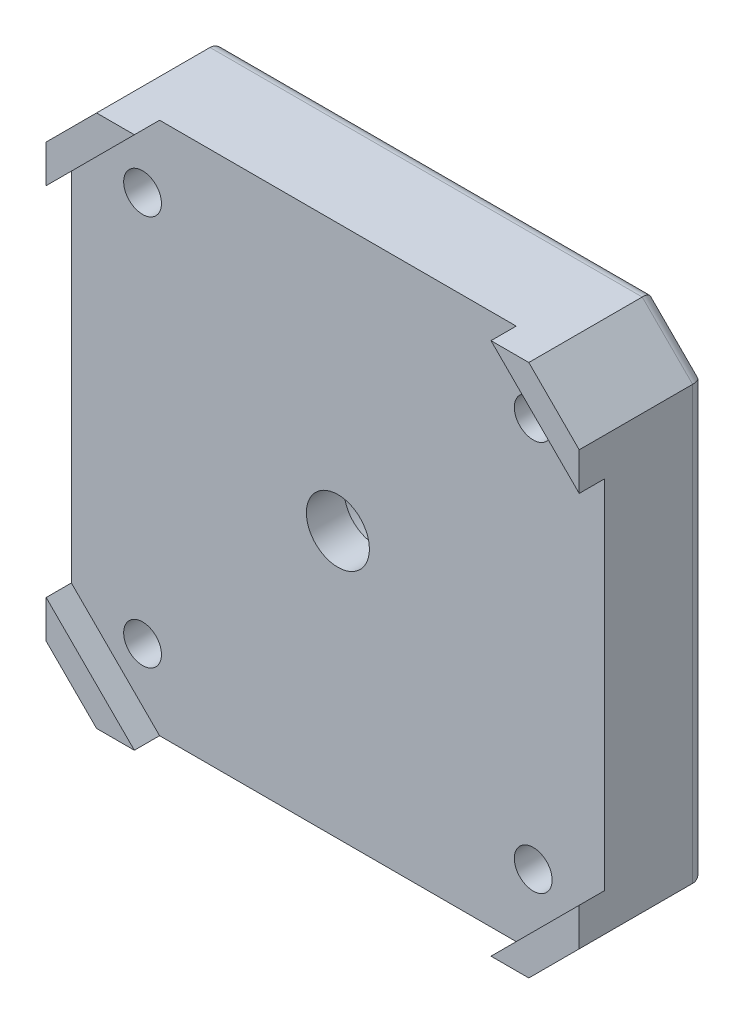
ISO-10303-21;
HEADER;
FILE_DESCRIPTION(('STEP AP214'),'2;1');
FILE_NAME('part.step','',(''),(''),'','','');
FILE_SCHEMA(('AUTOMOTIVE_DESIGN { 1 0 10303 214 1 1 1 1 }'));
ENDSEC;
DATA;
#1=APPLICATION_CONTEXT('core data for automotive mechanical design processes');
#2=APPLICATION_PROTOCOL_DEFINITION('international standard','automotive_design',2000,#1);
#3=PRODUCT_CONTEXT('',#1,'mechanical');
#4=PRODUCT('Part','Part','',(#3));
#5=PRODUCT_RELATED_PRODUCT_CATEGORY('part','',(#4));
#6=PRODUCT_DEFINITION_FORMATION('','',#4);
#7=PRODUCT_DEFINITION_CONTEXT('part definition',#1,'design');
#8=PRODUCT_DEFINITION('design','',#6,#7);
#9=PRODUCT_DEFINITION_SHAPE('','',#8);
#10=(LENGTH_UNIT() NAMED_UNIT(*) SI_UNIT(.MILLI.,.METRE.));
#11=(NAMED_UNIT(*) PLANE_ANGLE_UNIT() SI_UNIT($,.RADIAN.));
#12=(NAMED_UNIT(*) SI_UNIT($,.STERADIAN.) SOLID_ANGLE_UNIT());
#13=UNCERTAINTY_MEASURE_WITH_UNIT(LENGTH_MEASURE(1.E-05),#10,'distance_accuracy_value','');
#14=(GEOMETRIC_REPRESENTATION_CONTEXT(3) GLOBAL_UNCERTAINTY_ASSIGNED_CONTEXT((#13)) GLOBAL_UNIT_ASSIGNED_CONTEXT((#10,
#11,#12)) REPRESENTATION_CONTEXT('',''));
#15=CARTESIAN_POINT('',(0.,0.,0.));
#16=DIRECTION('',(0.,0.,1.));
#17=DIRECTION('',(1.,0.,0.));
#18=AXIS2_PLACEMENT_3D('',#15,#16,#17);
#19=CARTESIAN_POINT('',(-15.5,15.5,0.));
#20=DIRECTION('',(0.,0.,1.));
#21=DIRECTION('',(1.,0.,0.));
#22=AXIS2_PLACEMENT_3D('',#19,#20,#21);
#23=CYLINDRICAL_SURFACE('',#22,1.5);
#24=CARTESIAN_POINT('',(-15.5,15.5,8.));
#25=DIRECTION('',(0.,0.,1.));
#26=DIRECTION('',(1.,0.,0.));
#27=AXIS2_PLACEMENT_3D('',#24,#25,#26);
#28=CIRCLE('',#27,1.5);
#29=CARTESIAN_POINT('',(-14.,15.5,8.));
#30=VERTEX_POINT('',#29);
#31=EDGE_CURVE('E410',#30,#30,#28,.T.);
#32=ORIENTED_EDGE('',*,*,#31,.T.);
#33=EDGE_LOOP('',(#32));
#34=FACE_BOUND('',#33,.T.);
#35=CARTESIAN_POINT('',(-15.5,15.5,3.));
#36=DIRECTION('',(0.,0.,-1.));
#37=DIRECTION('',(-1.,0.,0.));
#38=AXIS2_PLACEMENT_3D('',#35,#36,#37);
#39=CIRCLE('',#38,1.5);
#40=CARTESIAN_POINT('',(-17.,15.5,3.));
#41=VERTEX_POINT('',#40);
#42=EDGE_CURVE('E262',#41,#41,#39,.F.);
#43=ORIENTED_EDGE('',*,*,#42,.F.);
#44=EDGE_LOOP('',(#43));
#45=FACE_BOUND('',#44,.T.);
#46=ADVANCED_FACE('F36',(#34,#45),#23,.F.);
#47=CARTESIAN_POINT('',(15.5,15.5,0.));
#48=DIRECTION('',(0.,0.,1.));
#49=DIRECTION('',(1.,0.,0.));
#50=AXIS2_PLACEMENT_3D('',#47,#48,#49);
#51=CYLINDRICAL_SURFACE('',#50,1.5);
#52=CARTESIAN_POINT('',(15.5,15.5,8.));
#53=DIRECTION('',(0.,0.,1.));
#54=DIRECTION('',(1.,0.,0.));
#55=AXIS2_PLACEMENT_3D('',#52,#53,#54);
#56=CIRCLE('',#55,1.5);
#57=CARTESIAN_POINT('',(17.,15.5,8.));
#58=VERTEX_POINT('',#57);
#59=EDGE_CURVE('E407',#58,#58,#56,.T.);
#60=ORIENTED_EDGE('',*,*,#59,.T.);
#61=EDGE_LOOP('',(#60));
#62=FACE_BOUND('',#61,.T.);
#63=CARTESIAN_POINT('',(15.5,15.5,3.));
#64=DIRECTION('',(0.,0.,-1.));
#65=DIRECTION('',(-1.,0.,0.));
#66=AXIS2_PLACEMENT_3D('',#63,#64,#65);
#67=CIRCLE('',#66,1.5);
#68=CARTESIAN_POINT('',(14.,15.5,3.));
#69=VERTEX_POINT('',#68);
#70=EDGE_CURVE('E259',#69,#69,#67,.F.);
#71=ORIENTED_EDGE('',*,*,#70,.F.);
#72=EDGE_LOOP('',(#71));
#73=FACE_BOUND('',#72,.T.);
#74=ADVANCED_FACE('F556',(#62,#73),#51,.F.);
#75=CARTESIAN_POINT('',(15.5,-15.5,0.));
#76=DIRECTION('',(0.,0.,1.));
#77=DIRECTION('',(1.,0.,0.));
#78=AXIS2_PLACEMENT_3D('',#75,#76,#77);
#79=CYLINDRICAL_SURFACE('',#78,1.5);
#80=CARTESIAN_POINT('',(15.5,-15.5,8.));
#81=DIRECTION('',(0.,0.,1.));
#82=DIRECTION('',(1.,0.,0.));
#83=AXIS2_PLACEMENT_3D('',#80,#81,#82);
#84=CIRCLE('',#83,1.5);
#85=CARTESIAN_POINT('',(17.,-15.5,8.));
#86=VERTEX_POINT('',#85);
#87=EDGE_CURVE('E411',#86,#86,#84,.T.);
#88=ORIENTED_EDGE('',*,*,#87,.T.);
#89=EDGE_LOOP('',(#88));
#90=FACE_BOUND('',#89,.T.);
#91=CARTESIAN_POINT('',(15.5,-15.5,3.));
#92=DIRECTION('',(0.,0.,-1.));
#93=DIRECTION('',(-1.,0.,0.));
#94=AXIS2_PLACEMENT_3D('',#91,#92,#93);
#95=CIRCLE('',#94,1.5);
#96=CARTESIAN_POINT('',(14.,-15.5,3.));
#97=VERTEX_POINT('',#96);
#98=EDGE_CURVE('E255',#97,#97,#95,.F.);
#99=ORIENTED_EDGE('',*,*,#98,.F.);
#100=EDGE_LOOP('',(#99));
#101=FACE_BOUND('',#100,.T.);
#102=ADVANCED_FACE('F558',(#90,#101),#79,.F.);
#103=CARTESIAN_POINT('',(-15.5,-15.5,0.));
#104=DIRECTION('',(0.,0.,1.));
#105=DIRECTION('',(1.,0.,0.));
#106=AXIS2_PLACEMENT_3D('',#103,#104,#105);
#107=CYLINDRICAL_SURFACE('',#106,1.5);
#108=CARTESIAN_POINT('',(-15.5,-15.5,8.));
#109=DIRECTION('',(0.,0.,1.));
#110=DIRECTION('',(1.,0.,0.));
#111=AXIS2_PLACEMENT_3D('',#108,#109,#110);
#112=CIRCLE('',#111,1.5);
#113=CARTESIAN_POINT('',(-14.,-15.5,8.));
#114=VERTEX_POINT('',#113);
#115=EDGE_CURVE('E265',#114,#114,#112,.T.);
#116=ORIENTED_EDGE('',*,*,#115,.T.);
#117=EDGE_LOOP('',(#116));
#118=FACE_BOUND('',#117,.T.);
#119=CARTESIAN_POINT('',(-15.5,-15.5,3.));
#120=DIRECTION('',(0.,0.,-1.));
#121=DIRECTION('',(-1.,0.,0.));
#122=AXIS2_PLACEMENT_3D('',#119,#120,#121);
#123=CIRCLE('',#122,1.5);
#124=CARTESIAN_POINT('',(-17.,-15.5,3.));
#125=VERTEX_POINT('',#124);
#126=EDGE_CURVE('E252',#125,#125,#123,.F.);
#127=ORIENTED_EDGE('',*,*,#126,.F.);
#128=EDGE_LOOP('',(#127));
#129=FACE_BOUND('',#128,.T.);
#130=ADVANCED_FACE('F565',(#118,#129),#107,.F.);
#131=CARTESIAN_POINT('',(0.,0.,10.));
#132=DIRECTION('',(0.,0.,-1.));
#133=DIRECTION('',(-1.,0.,0.));
#134=AXIS2_PLACEMENT_3D('',#131,#132,#133);
#135=PLANE('',#134);
#136=DIRECTION('',(0.,1.,0.));
#137=VECTOR('',#136,1.);
#138=CARTESIAN_POINT('',(21.15,17.15,10.));
#139=LINE('',#138,#137);
#140=CARTESIAN_POINT('',(21.15,-17.15,10.));
#141=VERTEX_POINT('',#140);
#142=CARTESIAN_POINT('',(21.15,-14.15,10.));
#143=VERTEX_POINT('',#142);
#144=EDGE_CURVE('E225',#141,#143,#139,.T.);
#145=ORIENTED_EDGE('',*,*,#144,.T.);
#146=DIRECTION('',(0.707106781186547,0.707106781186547,0.));
#147=VECTOR('',#146,1.);
#148=CARTESIAN_POINT('',(21.15,-14.15,10.));
#149=LINE('',#148,#147);
#150=CARTESIAN_POINT('',(14.15,-21.15,10.));
#151=VERTEX_POINT('',#150);
#152=EDGE_CURVE('E195',#151,#143,#149,.T.);
#153=ORIENTED_EDGE('',*,*,#152,.F.);
#154=DIRECTION('',(1.,0.,0.));
#155=VECTOR('',#154,1.);
#156=CARTESIAN_POINT('',(-17.15,-21.15,10.));
#157=LINE('',#156,#155);
#158=CARTESIAN_POINT('',(17.15,-21.15,10.));
#159=VERTEX_POINT('',#158);
#160=EDGE_CURVE('E219',#151,#159,#157,.T.);
#161=ORIENTED_EDGE('',*,*,#160,.T.);
#162=DIRECTION('',(0.707106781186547,0.707106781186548,0.));
#163=VECTOR('',#162,1.);
#164=CARTESIAN_POINT('',(21.15,-17.15,10.));
#165=LINE('',#164,#163);
#166=EDGE_CURVE('E223',#159,#141,#165,.T.);
#167=ORIENTED_EDGE('',*,*,#166,.T.);
#168=EDGE_LOOP('',(#145,#153,#161,#167));
#169=FACE_BOUND('',#168,.T.);
#170=ADVANCED_FACE('F572',(#169),#135,.F.);
#171=CARTESIAN_POINT('',(-17.15,-21.15,10.));
#172=VERTEX_POINT('',#171);
#173=CARTESIAN_POINT('',(-14.15,-21.15,10.));
#174=VERTEX_POINT('',#173);
#175=EDGE_CURVE('E220',#172,#174,#157,.T.);
#176=ORIENTED_EDGE('',*,*,#175,.T.);
#177=DIRECTION('',(0.707106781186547,-0.707106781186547,0.));
#178=VECTOR('',#177,1.);
#179=CARTESIAN_POINT('',(-21.15,-14.15,10.));
#180=LINE('',#179,#178);
#181=CARTESIAN_POINT('',(-21.15,-14.15,10.));
#182=VERTEX_POINT('',#181);
#183=EDGE_CURVE('E433',#182,#174,#180,.T.);
#184=ORIENTED_EDGE('',*,*,#183,.F.);
#185=DIRECTION('',(0.,-1.,0.));
#186=VECTOR('',#185,1.);
#187=CARTESIAN_POINT('',(-21.15,17.15,10.));
#188=LINE('',#187,#186);
#189=CARTESIAN_POINT('',(-21.15,-17.15,10.));
#190=VERTEX_POINT('',#189);
#191=EDGE_CURVE('E213',#182,#190,#188,.T.);
#192=ORIENTED_EDGE('',*,*,#191,.T.);
#193=DIRECTION('',(0.707106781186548,-0.707106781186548,0.));
#194=VECTOR('',#193,1.);
#195=CARTESIAN_POINT('',(-21.15,-17.15,10.));
#196=LINE('',#195,#194);
#197=EDGE_CURVE('E217',#190,#172,#196,.T.);
#198=ORIENTED_EDGE('',*,*,#197,.T.);
#199=EDGE_LOOP('',(#176,#184,#192,#198));
#200=FACE_BOUND('',#199,.T.);
#201=ADVANCED_FACE('F885',(#200),#135,.F.);
#202=CARTESIAN_POINT('',(-21.15,17.15,10.));
#203=VERTEX_POINT('',#202);
#204=CARTESIAN_POINT('',(-21.15,14.15,10.));
#205=VERTEX_POINT('',#204);
#206=EDGE_CURVE('E214',#203,#205,#188,.T.);
#207=ORIENTED_EDGE('',*,*,#206,.T.);
#208=DIRECTION('',(-0.707106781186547,-0.707106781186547,0.));
#209=VECTOR('',#208,1.);
#210=CARTESIAN_POINT('',(-14.15,21.15,10.));
#211=LINE('',#210,#209);
#212=CARTESIAN_POINT('',(-14.15,21.15,10.));
#213=VERTEX_POINT('',#212);
#214=EDGE_CURVE('E431',#213,#205,#211,.T.);
#215=ORIENTED_EDGE('',*,*,#214,.F.);
#216=DIRECTION('',(-1.,0.,0.));
#217=VECTOR('',#216,1.);
#218=CARTESIAN_POINT('',(-17.15,21.15,10.));
#219=LINE('',#218,#217);
#220=CARTESIAN_POINT('',(-17.15,21.15,10.));
#221=VERTEX_POINT('',#220);
#222=EDGE_CURVE('E211',#213,#221,#219,.T.);
#223=ORIENTED_EDGE('',*,*,#222,.T.);
#224=DIRECTION('',(-0.707106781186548,-0.707106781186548,0.));
#225=VECTOR('',#224,1.);
#226=CARTESIAN_POINT('',(-21.15,17.15,10.));
#227=LINE('',#226,#225);
#228=EDGE_CURVE('E210',#221,#203,#227,.T.);
#229=ORIENTED_EDGE('',*,*,#228,.T.);
#230=EDGE_LOOP('',(#207,#215,#223,#229));
#231=FACE_BOUND('',#230,.T.);
#232=ADVANCED_FACE('F454',(#231),#135,.F.);
#233=CARTESIAN_POINT('',(-17.15,21.15,10.));
#234=DIRECTION('',(0.,-1.,0.));
#235=DIRECTION('',(0.,0.,-1.));
#236=AXIS2_PLACEMENT_3D('',#233,#234,#235);
#237=PLANE('',#236);
#238=DIRECTION('',(0.,0.,-1.));
#239=VECTOR('',#238,1.);
#240=CARTESIAN_POINT('',(17.15,21.15,10.));
#241=LINE('',#240,#239);
#242=CARTESIAN_POINT('',(17.15,21.15,10.));
#243=VERTEX_POINT('',#242);
#244=CARTESIAN_POINT('',(17.15,21.15,0.999999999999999));
#245=VERTEX_POINT('',#244);
#246=EDGE_CURVE('E230',#243,#245,#241,.T.);
#247=ORIENTED_EDGE('',*,*,#246,.T.);
#248=DIRECTION('',(-1.,0.,0.));
#249=VECTOR('',#248,1.);
#250=CARTESIAN_POINT('',(-17.15,21.15,0.999999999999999));
#251=LINE('',#250,#249);
#252=CARTESIAN_POINT('',(-17.15,21.15,0.999999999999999));
#253=VERTEX_POINT('',#252);
#254=EDGE_CURVE('E343',#245,#253,#251,.T.);
#255=ORIENTED_EDGE('',*,*,#254,.T.);
#256=DIRECTION('',(0.,0.,-1.));
#257=VECTOR('',#256,1.);
#258=CARTESIAN_POINT('',(-17.15,21.15,10.));
#259=LINE('',#258,#257);
#260=EDGE_CURVE('E248',#221,#253,#259,.T.);
#261=ORIENTED_EDGE('',*,*,#260,.F.);
#262=ORIENTED_EDGE('',*,*,#222,.F.);
#263=DIRECTION('',(0.,0.,1.));
#264=VECTOR('',#263,1.);
#265=CARTESIAN_POINT('',(-14.15,21.15,8.));
#266=LINE('',#265,#264);
#267=CARTESIAN_POINT('',(-14.15,21.15,8.));
#268=VERTEX_POINT('',#267);
#269=EDGE_CURVE('E201',#268,#213,#266,.T.);
#270=ORIENTED_EDGE('',*,*,#269,.F.);
#271=DIRECTION('',(-1.,0.,0.));
#272=VECTOR('',#271,1.);
#273=CARTESIAN_POINT('',(-14.15,21.15,8.));
#274=LINE('',#273,#272);
#275=CARTESIAN_POINT('',(14.15,21.15,8.));
#276=VERTEX_POINT('',#275);
#277=EDGE_CURVE('E186',#276,#268,#274,.T.);
#278=ORIENTED_EDGE('',*,*,#277,.F.);
#279=DIRECTION('',(0.,0.,1.));
#280=VECTOR('',#279,1.);
#281=CARTESIAN_POINT('',(14.15,21.15,8.));
#282=LINE('',#281,#280);
#283=CARTESIAN_POINT('',(14.15,21.15,10.));
#284=VERTEX_POINT('',#283);
#285=EDGE_CURVE('E182',#276,#284,#282,.T.);
#286=ORIENTED_EDGE('',*,*,#285,.T.);
#287=EDGE_CURVE('E207',#243,#284,#219,.T.);
#288=ORIENTED_EDGE('',*,*,#287,.F.);
#289=EDGE_LOOP('',(#247,#255,#261,#262,#270,#278,#286,#288));
#290=FACE_BOUND('',#289,.T.);
#291=ADVANCED_FACE('F458',(#290),#237,.F.);
#292=CARTESIAN_POINT('',(-21.15,17.15,10.));
#293=DIRECTION('',(0.707106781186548,-0.707106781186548,0.));
#294=DIRECTION('',(0.707106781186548,0.707106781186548,0.));
#295=AXIS2_PLACEMENT_3D('',#292,#293,#294);
#296=PLANE('',#295);
#297=ORIENTED_EDGE('',*,*,#260,.T.);
#298=DIRECTION('',(-0.707106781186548,-0.707106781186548,0.));
#299=VECTOR('',#298,1.);
#300=CARTESIAN_POINT('',(-21.15,17.15,0.999999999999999));
#301=LINE('',#300,#299);
#302=CARTESIAN_POINT('',(-21.15,17.15,0.999999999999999));
#303=VERTEX_POINT('',#302);
#304=EDGE_CURVE('E313',#253,#303,#301,.T.);
#305=ORIENTED_EDGE('',*,*,#304,.T.);
#306=DIRECTION('',(0.,0.,-1.));
#307=VECTOR('',#306,1.);
#308=CARTESIAN_POINT('',(-21.15,17.15,10.));
#309=LINE('',#308,#307);
#310=EDGE_CURVE('E245',#203,#303,#309,.T.);
#311=ORIENTED_EDGE('',*,*,#310,.F.);
#312=ORIENTED_EDGE('',*,*,#228,.F.);
#313=EDGE_LOOP('',(#297,#305,#311,#312));
#314=FACE_BOUND('',#313,.T.);
#315=ADVANCED_FACE('F462',(#314),#296,.F.);
#316=CARTESIAN_POINT('',(-21.15,17.15,10.));
#317=DIRECTION('',(1.,0.,0.));
#318=DIRECTION('',(0.,1.,0.));
#319=AXIS2_PLACEMENT_3D('',#316,#317,#318);
#320=PLANE('',#319);
#321=ORIENTED_EDGE('',*,*,#310,.T.);
#322=DIRECTION('',(0.,-1.,0.));
#323=VECTOR('',#322,1.);
#324=CARTESIAN_POINT('',(-21.15,-17.15,0.999999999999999));
#325=LINE('',#324,#323);
#326=CARTESIAN_POINT('',(-21.15,-17.15,0.999999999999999));
#327=VERTEX_POINT('',#326);
#328=EDGE_CURVE('E333',#303,#327,#325,.T.);
#329=ORIENTED_EDGE('',*,*,#328,.T.);
#330=DIRECTION('',(0.,0.,-1.));
#331=VECTOR('',#330,1.);
#332=CARTESIAN_POINT('',(-21.15,-17.15,10.));
#333=LINE('',#332,#331);
#334=EDGE_CURVE('E242',#190,#327,#333,.T.);
#335=ORIENTED_EDGE('',*,*,#334,.F.);
#336=ORIENTED_EDGE('',*,*,#191,.F.);
#337=DIRECTION('',(0.,0.,1.));
#338=VECTOR('',#337,1.);
#339=CARTESIAN_POINT('',(-21.15,-14.15,8.));
#340=LINE('',#339,#338);
#341=CARTESIAN_POINT('',(-21.15,-14.15,8.));
#342=VERTEX_POINT('',#341);
#343=EDGE_CURVE('E443',#342,#182,#340,.T.);
#344=ORIENTED_EDGE('',*,*,#343,.F.);
#345=DIRECTION('',(0.,-1.,0.));
#346=VECTOR('',#345,1.);
#347=CARTESIAN_POINT('',(-21.15,14.15,8.));
#348=LINE('',#347,#346);
#349=CARTESIAN_POINT('',(-21.15,14.15,8.));
#350=VERTEX_POINT('',#349);
#351=EDGE_CURVE('E423',#350,#342,#348,.T.);
#352=ORIENTED_EDGE('',*,*,#351,.F.);
#353=DIRECTION('',(0.,0.,1.));
#354=VECTOR('',#353,1.);
#355=CARTESIAN_POINT('',(-21.15,14.15,8.));
#356=LINE('',#355,#354);
#357=EDGE_CURVE('E445',#350,#205,#356,.T.);
#358=ORIENTED_EDGE('',*,*,#357,.T.);
#359=ORIENTED_EDGE('',*,*,#206,.F.);
#360=EDGE_LOOP('',(#321,#329,#335,#336,#344,#352,#358,#359));
#361=FACE_BOUND('',#360,.T.);
#362=ADVANCED_FACE('F478',(#361),#320,.F.);
#363=CARTESIAN_POINT('',(-21.15,-17.15,10.));
#364=DIRECTION('',(0.707106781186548,0.707106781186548,0.));
#365=DIRECTION('',(-0.707106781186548,0.707106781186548,0.));
#366=AXIS2_PLACEMENT_3D('',#363,#364,#365);
#367=PLANE('',#366);
#368=ORIENTED_EDGE('',*,*,#334,.T.);
#369=DIRECTION('',(0.707106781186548,-0.707106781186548,0.));
#370=VECTOR('',#369,1.);
#371=CARTESIAN_POINT('',(-17.15,-21.15,0.999999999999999));
#372=LINE('',#371,#370);
#373=CARTESIAN_POINT('',(-17.15,-21.15,0.999999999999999));
#374=VERTEX_POINT('',#373);
#375=EDGE_CURVE('E335',#327,#374,#372,.T.);
#376=ORIENTED_EDGE('',*,*,#375,.T.);
#377=DIRECTION('',(0.,0.,-1.));
#378=VECTOR('',#377,1.);
#379=CARTESIAN_POINT('',(-17.15,-21.15,10.));
#380=LINE('',#379,#378);
#381=EDGE_CURVE('E239',#172,#374,#380,.T.);
#382=ORIENTED_EDGE('',*,*,#381,.F.);
#383=ORIENTED_EDGE('',*,*,#197,.F.);
#384=EDGE_LOOP('',(#368,#376,#382,#383));
#385=FACE_BOUND('',#384,.T.);
#386=ADVANCED_FACE('F483',(#385),#367,.F.);
#387=CARTESIAN_POINT('',(-17.15,-21.15,10.));
#388=DIRECTION('',(0.,1.,0.));
#389=DIRECTION('',(0.,0.,1.));
#390=AXIS2_PLACEMENT_3D('',#387,#388,#389);
#391=PLANE('',#390);
#392=ORIENTED_EDGE('',*,*,#381,.T.);
#393=DIRECTION('',(1.,0.,0.));
#394=VECTOR('',#393,1.);
#395=CARTESIAN_POINT('',(17.15,-21.15,0.999999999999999));
#396=LINE('',#395,#394);
#397=CARTESIAN_POINT('',(17.15,-21.15,0.999999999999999));
#398=VERTEX_POINT('',#397);
#399=EDGE_CURVE('E337',#374,#398,#396,.T.);
#400=ORIENTED_EDGE('',*,*,#399,.T.);
#401=DIRECTION('',(0.,0.,-1.));
#402=VECTOR('',#401,1.);
#403=CARTESIAN_POINT('',(17.15,-21.15,10.));
#404=LINE('',#403,#402);
#405=EDGE_CURVE('E236',#159,#398,#404,.T.);
#406=ORIENTED_EDGE('',*,*,#405,.F.);
#407=ORIENTED_EDGE('',*,*,#160,.F.);
#408=DIRECTION('',(0.,0.,1.));
#409=VECTOR('',#408,1.);
#410=CARTESIAN_POINT('',(14.15,-21.15,8.));
#411=LINE('',#410,#409);
#412=CARTESIAN_POINT('',(14.15,-21.15,8.));
#413=VERTEX_POINT('',#412);
#414=EDGE_CURVE('E438',#413,#151,#411,.T.);
#415=ORIENTED_EDGE('',*,*,#414,.F.);
#416=DIRECTION('',(1.,0.,0.));
#417=VECTOR('',#416,1.);
#418=CARTESIAN_POINT('',(-14.15,-21.15,8.));
#419=LINE('',#418,#417);
#420=CARTESIAN_POINT('',(-14.15,-21.15,8.));
#421=VERTEX_POINT('',#420);
#422=EDGE_CURVE('E203',#421,#413,#419,.T.);
#423=ORIENTED_EDGE('',*,*,#422,.F.);
#424=DIRECTION('',(0.,0.,1.));
#425=VECTOR('',#424,1.);
#426=CARTESIAN_POINT('',(-14.15,-21.15,8.));
#427=LINE('',#426,#425);
#428=EDGE_CURVE('E440',#421,#174,#427,.T.);
#429=ORIENTED_EDGE('',*,*,#428,.T.);
#430=ORIENTED_EDGE('',*,*,#175,.F.);
#431=EDGE_LOOP('',(#392,#400,#406,#407,#415,#423,#429,#430));
#432=FACE_BOUND('',#431,.T.);
#433=ADVANCED_FACE('F496',(#432),#391,.F.);
#434=CARTESIAN_POINT('',(21.15,-17.15,10.));
#435=DIRECTION('',(-0.707106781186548,0.707106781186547,0.));
#436=DIRECTION('',(-0.707106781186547,-0.707106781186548,0.));
#437=AXIS2_PLACEMENT_3D('',#434,#435,#436);
#438=PLANE('',#437);
#439=ORIENTED_EDGE('',*,*,#405,.T.);
#440=DIRECTION('',(0.707106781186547,0.707106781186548,0.));
#441=VECTOR('',#440,1.);
#442=CARTESIAN_POINT('',(21.15,-17.15,0.999999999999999));
#443=LINE('',#442,#441);
#444=CARTESIAN_POINT('',(21.15,-17.15,0.999999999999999));
#445=VERTEX_POINT('',#444);
#446=EDGE_CURVE('E339',#398,#445,#443,.T.);
#447=ORIENTED_EDGE('',*,*,#446,.T.);
#448=DIRECTION('',(0.,0.,-1.));
#449=VECTOR('',#448,1.);
#450=CARTESIAN_POINT('',(21.15,-17.15,10.));
#451=LINE('',#450,#449);
#452=EDGE_CURVE('E234',#141,#445,#451,.T.);
#453=ORIENTED_EDGE('',*,*,#452,.F.);
#454=ORIENTED_EDGE('',*,*,#166,.F.);
#455=EDGE_LOOP('',(#439,#447,#453,#454));
#456=FACE_BOUND('',#455,.T.);
#457=ADVANCED_FACE('F502',(#456),#438,.F.);
#458=CARTESIAN_POINT('',(21.15,17.15,10.));
#459=DIRECTION('',(-1.,0.,0.));
#460=DIRECTION('',(0.,-1.,0.));
#461=AXIS2_PLACEMENT_3D('',#458,#459,#460);
#462=PLANE('',#461);
#463=ORIENTED_EDGE('',*,*,#452,.T.);
#464=DIRECTION('',(0.,1.,0.));
#465=VECTOR('',#464,1.);
#466=CARTESIAN_POINT('',(21.15,17.15,0.999999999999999));
#467=LINE('',#466,#465);
#468=CARTESIAN_POINT('',(21.15,17.15,0.999999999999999));
#469=VERTEX_POINT('',#468);
#470=EDGE_CURVE('E59',#445,#469,#467,.T.);
#471=ORIENTED_EDGE('',*,*,#470,.T.);
#472=DIRECTION('',(0.,0.,-1.));
#473=VECTOR('',#472,1.);
#474=CARTESIAN_POINT('',(21.15,17.15,10.));
#475=LINE('',#474,#473);
#476=CARTESIAN_POINT('',(21.15,17.15,10.));
#477=VERTEX_POINT('',#476);
#478=EDGE_CURVE('E232',#477,#469,#475,.T.);
#479=ORIENTED_EDGE('',*,*,#478,.F.);
#480=CARTESIAN_POINT('',(21.15,14.15,10.));
#481=VERTEX_POINT('',#480);
#482=EDGE_CURVE('E199',#481,#477,#139,.T.);
#483=ORIENTED_EDGE('',*,*,#482,.F.);
#484=DIRECTION('',(0.,0.,1.));
#485=VECTOR('',#484,1.);
#486=CARTESIAN_POINT('',(21.15,14.15,8.));
#487=LINE('',#486,#485);
#488=CARTESIAN_POINT('',(21.15,14.15,8.));
#489=VERTEX_POINT('',#488);
#490=EDGE_CURVE('E179',#489,#481,#487,.T.);
#491=ORIENTED_EDGE('',*,*,#490,.F.);
#492=DIRECTION('',(0.,1.,0.));
#493=VECTOR('',#492,1.);
#494=CARTESIAN_POINT('',(21.15,14.15,8.));
#495=LINE('',#494,#493);
#496=CARTESIAN_POINT('',(21.15,-14.15,8.));
#497=VERTEX_POINT('',#496);
#498=EDGE_CURVE('E187',#497,#489,#495,.T.);
#499=ORIENTED_EDGE('',*,*,#498,.F.);
#500=DIRECTION('',(0.,0.,1.));
#501=VECTOR('',#500,1.);
#502=CARTESIAN_POINT('',(21.15,-14.15,8.));
#503=LINE('',#502,#501);
#504=EDGE_CURVE('E436',#497,#143,#503,.T.);
#505=ORIENTED_EDGE('',*,*,#504,.T.);
#506=ORIENTED_EDGE('',*,*,#144,.F.);
#507=EDGE_LOOP('',(#463,#471,#479,#483,#491,#499,#505,#506));
#508=FACE_BOUND('',#507,.T.);
#509=ADVANCED_FACE('F198',(#508),#462,.F.);
#510=CARTESIAN_POINT('',(17.15,21.15,10.));
#511=DIRECTION('',(-0.707106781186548,-0.707106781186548,0.));
#512=DIRECTION('',(0.707106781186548,-0.707106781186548,0.));
#513=AXIS2_PLACEMENT_3D('',#510,#511,#512);
#514=PLANE('',#513);
#515=ORIENTED_EDGE('',*,*,#478,.T.);
#516=DIRECTION('',(-0.707106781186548,0.707106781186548,0.));
#517=VECTOR('',#516,1.);
#518=CARTESIAN_POINT('',(17.15,21.15,0.999999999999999));
#519=LINE('',#518,#517);
#520=EDGE_CURVE('E51',#469,#245,#519,.T.);
#521=ORIENTED_EDGE('',*,*,#520,.T.);
#522=ORIENTED_EDGE('',*,*,#246,.F.);
#523=DIRECTION('',(-0.707106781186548,0.707106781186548,0.));
#524=VECTOR('',#523,1.);
#525=CARTESIAN_POINT('',(17.15,21.15,10.));
#526=LINE('',#525,#524);
#527=EDGE_CURVE('E228',#477,#243,#526,.T.);
#528=ORIENTED_EDGE('',*,*,#527,.F.);
#529=EDGE_LOOP('',(#515,#521,#522,#528));
#530=FACE_BOUND('',#529,.T.);
#531=ADVANCED_FACE('F591',(#530),#514,.F.);
#532=ORIENTED_EDGE('',*,*,#287,.T.);
#533=DIRECTION('',(-0.707106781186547,0.707106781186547,0.));
#534=VECTOR('',#533,1.);
#535=CARTESIAN_POINT('',(14.15,21.15,10.));
#536=LINE('',#535,#534);
#537=EDGE_CURVE('E417',#481,#284,#536,.T.);
#538=ORIENTED_EDGE('',*,*,#537,.F.);
#539=ORIENTED_EDGE('',*,*,#482,.T.);
#540=ORIENTED_EDGE('',*,*,#527,.T.);
#541=EDGE_LOOP('',(#532,#538,#539,#540));
#542=FACE_BOUND('',#541,.T.);
#543=ADVANCED_FACE('F519',(#542),#135,.F.);
#544=CARTESIAN_POINT('',(0.,0.,0.));
#545=DIRECTION('',(0.,0.,-1.));
#546=DIRECTION('',(-1.,0.,0.));
#547=AXIS2_PLACEMENT_3D('',#544,#545,#546);
#548=PLANE('',#547);
#549=CARTESIAN_POINT('',(0.,0.,0.));
#550=DIRECTION('',(0.,0.,-1.));
#551=DIRECTION('',(-1.,0.,0.));
#552=AXIS2_PLACEMENT_3D('',#549,#550,#551);
#553=CIRCLE('',#552,6.);
#554=CARTESIAN_POINT('',(-6.,0.,0.));
#555=VERTEX_POINT('',#554);
#556=EDGE_CURVE('E44',#555,#555,#553,.F.);
#557=ORIENTED_EDGE('',*,*,#556,.T.);
#558=EDGE_LOOP('',(#557));
#559=FACE_BOUND('',#558,.T.);
#560=DIRECTION('',(0.,-1.,0.));
#561=VECTOR('',#560,1.);
#562=CARTESIAN_POINT('',(-20.15,17.15,0.));
#563=LINE('',#562,#561);
#564=CARTESIAN_POINT('',(-20.15,-16.7357864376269,0.));
#565=VERTEX_POINT('',#564);
#566=CARTESIAN_POINT('',(-20.15,16.7357864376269,0.));
#567=VERTEX_POINT('',#566);
#568=EDGE_CURVE('E328',#565,#567,#563,.F.);
#569=ORIENTED_EDGE('',*,*,#568,.T.);
#570=DIRECTION('',(-0.707106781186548,-0.707106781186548,0.));
#571=VECTOR('',#570,1.);
#572=CARTESIAN_POINT('',(-16.4428932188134,20.4428932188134,0.));
#573=LINE('',#572,#571);
#574=CARTESIAN_POINT('',(-16.7357864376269,20.15,0.));
#575=VERTEX_POINT('',#574);
#576=EDGE_CURVE('E330',#567,#575,#573,.F.);
#577=ORIENTED_EDGE('',*,*,#576,.T.);
#578=DIRECTION('',(-1.,0.,0.));
#579=VECTOR('',#578,1.);
#580=CARTESIAN_POINT('',(17.15,20.15,0.));
#581=LINE('',#580,#579);
#582=CARTESIAN_POINT('',(16.7357864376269,20.15,0.));
#583=VERTEX_POINT('',#582);
#584=EDGE_CURVE('E316',#575,#583,#581,.F.);
#585=ORIENTED_EDGE('',*,*,#584,.T.);
#586=DIRECTION('',(-0.707106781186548,0.707106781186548,0.));
#587=VECTOR('',#586,1.);
#588=CARTESIAN_POINT('',(20.4428932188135,16.4428932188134,0.));
#589=LINE('',#588,#587);
#590=CARTESIAN_POINT('',(20.15,16.7357864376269,0.));
#591=VERTEX_POINT('',#590);
#592=EDGE_CURVE('E318',#583,#591,#589,.F.);
#593=ORIENTED_EDGE('',*,*,#592,.T.);
#594=DIRECTION('',(0.,1.,0.));
#595=VECTOR('',#594,1.);
#596=CARTESIAN_POINT('',(20.15,-17.15,0.));
#597=LINE('',#596,#595);
#598=CARTESIAN_POINT('',(20.15,-16.7357864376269,0.));
#599=VERTEX_POINT('',#598);
#600=EDGE_CURVE('E320',#591,#599,#597,.F.);
#601=ORIENTED_EDGE('',*,*,#600,.T.);
#602=DIRECTION('',(0.707106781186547,0.707106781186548,0.));
#603=VECTOR('',#602,1.);
#604=CARTESIAN_POINT('',(16.4428932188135,-20.4428932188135,0.));
#605=LINE('',#604,#603);
#606=CARTESIAN_POINT('',(16.7357864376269,-20.15,0.));
#607=VERTEX_POINT('',#606);
#608=EDGE_CURVE('E322',#599,#607,#605,.F.);
#609=ORIENTED_EDGE('',*,*,#608,.T.);
#610=DIRECTION('',(1.,0.,0.));
#611=VECTOR('',#610,1.);
#612=CARTESIAN_POINT('',(-17.15,-20.15,0.));
#613=LINE('',#612,#611);
#614=CARTESIAN_POINT('',(-16.7357864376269,-20.15,0.));
#615=VERTEX_POINT('',#614);
#616=EDGE_CURVE('E324',#607,#615,#613,.F.);
#617=ORIENTED_EDGE('',*,*,#616,.T.);
#618=DIRECTION('',(0.707106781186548,-0.707106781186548,0.));
#619=VECTOR('',#618,1.);
#620=CARTESIAN_POINT('',(-20.4428932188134,-16.4428932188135,0.));
#621=LINE('',#620,#619);
#622=EDGE_CURVE('E326',#615,#565,#621,.F.);
#623=ORIENTED_EDGE('',*,*,#622,.T.);
#624=EDGE_LOOP('',(#569,#577,#585,#593,#601,#609,#617,#623));
#625=FACE_BOUND('',#624,.T.);
#626=CARTESIAN_POINT('',(-15.5,-15.5,0.));
#627=DIRECTION('',(0.,0.,-1.));
#628=DIRECTION('',(-1.,0.,0.));
#629=AXIS2_PLACEMENT_3D('',#626,#627,#628);
#630=CIRCLE('',#629,3.6);
#631=CARTESIAN_POINT('',(-19.1,-15.5,0.));
#632=VERTEX_POINT('',#631);
#633=EDGE_CURVE('E280',#632,#632,#630,.F.);
#634=ORIENTED_EDGE('',*,*,#633,.T.);
#635=EDGE_LOOP('',(#634));
#636=FACE_BOUND('',#635,.T.);
#637=CARTESIAN_POINT('',(15.5,-15.5,0.));
#638=DIRECTION('',(0.,0.,-1.));
#639=DIRECTION('',(-1.,0.,0.));
#640=AXIS2_PLACEMENT_3D('',#637,#638,#639);
#641=CIRCLE('',#640,3.6);
#642=CARTESIAN_POINT('',(11.9,-15.5,0.));
#643=VERTEX_POINT('',#642);
#644=EDGE_CURVE('E277',#643,#643,#641,.F.);
#645=ORIENTED_EDGE('',*,*,#644,.T.);
#646=EDGE_LOOP('',(#645));
#647=FACE_BOUND('',#646,.T.);
#648=CARTESIAN_POINT('',(-15.5,15.5,0.));
#649=DIRECTION('',(0.,0.,-1.));
#650=DIRECTION('',(-1.,0.,0.));
#651=AXIS2_PLACEMENT_3D('',#648,#649,#650);
#652=CIRCLE('',#651,3.6);
#653=CARTESIAN_POINT('',(-19.1,15.5,0.));
#654=VERTEX_POINT('',#653);
#655=EDGE_CURVE('E274',#654,#654,#652,.F.);
#656=ORIENTED_EDGE('',*,*,#655,.T.);
#657=EDGE_LOOP('',(#656));
#658=FACE_BOUND('',#657,.T.);
#659=CARTESIAN_POINT('',(15.5,15.5,0.));
#660=DIRECTION('',(0.,0.,-1.));
#661=DIRECTION('',(-1.,0.,0.));
#662=AXIS2_PLACEMENT_3D('',#659,#660,#661);
#663=CIRCLE('',#662,3.6);
#664=CARTESIAN_POINT('',(11.9,15.5,0.));
#665=VERTEX_POINT('',#664);
#666=EDGE_CURVE('E271',#665,#665,#663,.F.);
#667=ORIENTED_EDGE('',*,*,#666,.T.);
#668=EDGE_LOOP('',(#667));
#669=FACE_BOUND('',#668,.T.);
#670=ADVANCED_FACE('F378',(#559,#625,#636,#647,#658,#669),#548,.T.);
#671=CARTESIAN_POINT('',(21.15,-14.15,8.));
#672=DIRECTION('',(0.707106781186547,-0.707106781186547,0.));
#673=DIRECTION('',(0.707106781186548,0.707106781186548,0.));
#674=AXIS2_PLACEMENT_3D('',#671,#672,#673);
#675=PLANE('',#674);
#676=ORIENTED_EDGE('',*,*,#152,.T.);
#677=ORIENTED_EDGE('',*,*,#504,.F.);
#678=DIRECTION('',(0.707106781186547,0.707106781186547,0.));
#679=VECTOR('',#678,1.);
#680=CARTESIAN_POINT('',(21.15,-14.15,8.));
#681=LINE('',#680,#679);
#682=EDGE_CURVE('E193',#413,#497,#681,.T.);
#683=ORIENTED_EDGE('',*,*,#682,.F.);
#684=ORIENTED_EDGE('',*,*,#414,.T.);
#685=EDGE_LOOP('',(#676,#677,#683,#684));
#686=FACE_BOUND('',#685,.T.);
#687=ADVANCED_FACE('F518',(#686),#675,.F.);
#688=CARTESIAN_POINT('',(-21.15,-14.15,8.));
#689=DIRECTION('',(-0.707106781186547,-0.707106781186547,0.));
#690=DIRECTION('',(0.707106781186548,-0.707106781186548,0.));
#691=AXIS2_PLACEMENT_3D('',#688,#689,#690);
#692=PLANE('',#691);
#693=ORIENTED_EDGE('',*,*,#183,.T.);
#694=ORIENTED_EDGE('',*,*,#428,.F.);
#695=DIRECTION('',(0.707106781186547,-0.707106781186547,0.));
#696=VECTOR('',#695,1.);
#697=CARTESIAN_POINT('',(-21.15,-14.15,8.));
#698=LINE('',#697,#696);
#699=EDGE_CURVE('E426',#342,#421,#698,.T.);
#700=ORIENTED_EDGE('',*,*,#699,.F.);
#701=ORIENTED_EDGE('',*,*,#343,.T.);
#702=EDGE_LOOP('',(#693,#694,#700,#701));
#703=FACE_BOUND('',#702,.T.);
#704=ADVANCED_FACE('F581',(#703),#692,.F.);
#705=CARTESIAN_POINT('',(-14.15,21.15,8.));
#706=DIRECTION('',(-0.707106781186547,0.707106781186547,0.));
#707=DIRECTION('',(-0.707106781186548,-0.707106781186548,0.));
#708=AXIS2_PLACEMENT_3D('',#705,#706,#707);
#709=PLANE('',#708);
#710=ORIENTED_EDGE('',*,*,#214,.T.);
#711=ORIENTED_EDGE('',*,*,#357,.F.);
#712=DIRECTION('',(-0.707106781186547,-0.707106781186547,0.));
#713=VECTOR('',#712,1.);
#714=CARTESIAN_POINT('',(-14.15,21.15,8.));
#715=LINE('',#714,#713);
#716=EDGE_CURVE('E420',#268,#350,#715,.T.);
#717=ORIENTED_EDGE('',*,*,#716,.F.);
#718=ORIENTED_EDGE('',*,*,#269,.T.);
#719=EDGE_LOOP('',(#710,#711,#717,#718));
#720=FACE_BOUND('',#719,.T.);
#721=ADVANCED_FACE('F450',(#720),#709,.F.);
#722=CARTESIAN_POINT('',(14.15,21.15,8.));
#723=DIRECTION('',(0.707106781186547,0.707106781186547,0.));
#724=DIRECTION('',(-0.707106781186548,0.707106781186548,0.));
#725=AXIS2_PLACEMENT_3D('',#722,#723,#724);
#726=PLANE('',#725);
#727=ORIENTED_EDGE('',*,*,#537,.T.);
#728=ORIENTED_EDGE('',*,*,#285,.F.);
#729=DIRECTION('',(-0.707106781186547,0.707106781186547,0.));
#730=VECTOR('',#729,1.);
#731=CARTESIAN_POINT('',(14.15,21.15,8.));
#732=LINE('',#731,#730);
#733=EDGE_CURVE('E175',#489,#276,#732,.T.);
#734=ORIENTED_EDGE('',*,*,#733,.F.);
#735=ORIENTED_EDGE('',*,*,#490,.T.);
#736=EDGE_LOOP('',(#727,#728,#734,#735));
#737=FACE_BOUND('',#736,.T.);
#738=ADVANCED_FACE('F177',(#737),#726,.F.);
#739=CARTESIAN_POINT('',(0.,0.,8.));
#740=DIRECTION('',(0.,0.,1.));
#741=DIRECTION('',(1.,0.,0.));
#742=AXIS2_PLACEMENT_3D('',#739,#740,#741);
#743=PLANE('',#742);
#744=CARTESIAN_POINT('',(0.,0.,8.));
#745=DIRECTION('',(0.,0.,1.));
#746=DIRECTION('',(1.,0.,0.));
#747=AXIS2_PLACEMENT_3D('',#744,#745,#746);
#748=CIRCLE('',#747,2.5);
#749=CARTESIAN_POINT('',(2.5,0.,8.));
#750=VERTEX_POINT('',#749);
#751=EDGE_CURVE('E349',#750,#750,#748,.T.);
#752=ORIENTED_EDGE('',*,*,#751,.F.);
#753=EDGE_LOOP('',(#752));
#754=FACE_BOUND('',#753,.T.);
#755=ORIENTED_EDGE('',*,*,#115,.F.);
#756=EDGE_LOOP('',(#755));
#757=FACE_BOUND('',#756,.T.);
#758=ORIENTED_EDGE('',*,*,#87,.F.);
#759=EDGE_LOOP('',(#758));
#760=FACE_BOUND('',#759,.T.);
#761=ORIENTED_EDGE('',*,*,#59,.F.);
#762=EDGE_LOOP('',(#761));
#763=FACE_BOUND('',#762,.T.);
#764=ORIENTED_EDGE('',*,*,#31,.F.);
#765=EDGE_LOOP('',(#764));
#766=FACE_BOUND('',#765,.T.);
#767=ORIENTED_EDGE('',*,*,#498,.T.);
#768=ORIENTED_EDGE('',*,*,#733,.T.);
#769=ORIENTED_EDGE('',*,*,#277,.T.);
#770=ORIENTED_EDGE('',*,*,#716,.T.);
#771=ORIENTED_EDGE('',*,*,#351,.T.);
#772=ORIENTED_EDGE('',*,*,#699,.T.);
#773=ORIENTED_EDGE('',*,*,#422,.T.);
#774=ORIENTED_EDGE('',*,*,#682,.T.);
#775=EDGE_LOOP('',(#767,#768,#769,#770,#771,#772,#773,#774));
#776=FACE_BOUND('',#775,.T.);
#777=ADVANCED_FACE('F191',(#754,#757,#760,#763,#766,#776),#743,.T.);
#778=CARTESIAN_POINT('',(-15.5,-15.5,3.));
#779=DIRECTION('',(0.,0.,-1.));
#780=DIRECTION('',(-1.,0.,0.));
#781=AXIS2_PLACEMENT_3D('',#778,#779,#780);
#782=PLANE('',#781);
#783=CARTESIAN_POINT('',(-15.5,-15.5,3.));
#784=DIRECTION('',(0.,0.,-1.));
#785=DIRECTION('',(-1.,0.,0.));
#786=AXIS2_PLACEMENT_3D('',#783,#784,#785);
#787=CIRCLE('',#786,2.6);
#788=CARTESIAN_POINT('',(-18.1,-15.5,3.));
#789=VERTEX_POINT('',#788);
#790=EDGE_CURVE('E283',#789,#789,#787,.T.);
#791=ORIENTED_EDGE('',*,*,#790,.T.);
#792=EDGE_LOOP('',(#791));
#793=FACE_BOUND('',#792,.T.);
#794=ORIENTED_EDGE('',*,*,#126,.T.);
#795=EDGE_LOOP('',(#794));
#796=FACE_BOUND('',#795,.T.);
#797=ADVANCED_FACE('F577',(#793,#796),#782,.T.);
#798=CARTESIAN_POINT('',(-15.5,-15.5,3.));
#799=DIRECTION('',(0.,0.,-1.));
#800=DIRECTION('',(-1.,0.,0.));
#801=AXIS2_PLACEMENT_3D('',#798,#799,#800);
#802=CYLINDRICAL_SURFACE('',#801,3.1);
#803=CARTESIAN_POINT('',(-15.5,-15.5,0.5));
#804=DIRECTION('',(0.,0.,-1.));
#805=DIRECTION('',(-1.,0.,0.));
#806=AXIS2_PLACEMENT_3D('',#803,#804,#805);
#807=CIRCLE('',#806,3.1);
#808=CARTESIAN_POINT('',(-18.6,-15.5,0.5));
#809=VERTEX_POINT('',#808);
#810=EDGE_CURVE('E268',#809,#809,#807,.T.);
#811=ORIENTED_EDGE('',*,*,#810,.T.);
#812=EDGE_LOOP('',(#811));
#813=FACE_BOUND('',#812,.T.);
#814=CARTESIAN_POINT('',(-15.5,-15.5,2.5));
#815=DIRECTION('',(0.,0.,-1.));
#816=DIRECTION('',(-1.,0.,0.));
#817=AXIS2_PLACEMENT_3D('',#814,#815,#816);
#818=CIRCLE('',#817,3.1);
#819=CARTESIAN_POINT('',(-18.6,-15.5,2.5));
#820=VERTEX_POINT('',#819);
#821=EDGE_CURVE('E251',#820,#820,#818,.F.);
#822=ORIENTED_EDGE('',*,*,#821,.T.);
#823=EDGE_LOOP('',(#822));
#824=FACE_BOUND('',#823,.T.);
#825=ADVANCED_FACE('F816',(#813,#824),#802,.F.);
#826=CARTESIAN_POINT('',(15.5,-15.5,3.));
#827=DIRECTION('',(0.,0.,-1.));
#828=DIRECTION('',(-1.,0.,0.));
#829=AXIS2_PLACEMENT_3D('',#826,#827,#828);
#830=PLANE('',#829);
#831=CARTESIAN_POINT('',(15.5,-15.5,3.));
#832=DIRECTION('',(0.,0.,-1.));
#833=DIRECTION('',(-1.,0.,0.));
#834=AXIS2_PLACEMENT_3D('',#831,#832,#833);
#835=CIRCLE('',#834,2.6);
#836=CARTESIAN_POINT('',(12.9,-15.5,3.));
#837=VERTEX_POINT('',#836);
#838=EDGE_CURVE('E292',#837,#837,#835,.T.);
#839=ORIENTED_EDGE('',*,*,#838,.T.);
#840=EDGE_LOOP('',(#839));
#841=FACE_BOUND('',#840,.T.);
#842=ORIENTED_EDGE('',*,*,#98,.T.);
#843=EDGE_LOOP('',(#842));
#844=FACE_BOUND('',#843,.T.);
#845=ADVANCED_FACE('F807',(#841,#844),#830,.T.);
#846=CARTESIAN_POINT('',(15.5,-15.5,3.));
#847=DIRECTION('',(0.,0.,-1.));
#848=DIRECTION('',(-1.,0.,0.));
#849=AXIS2_PLACEMENT_3D('',#846,#847,#848);
#850=CYLINDRICAL_SURFACE('',#849,3.1);
#851=CARTESIAN_POINT('',(15.5,-15.5,0.5));
#852=DIRECTION('',(0.,0.,-1.));
#853=DIRECTION('',(-1.,0.,0.));
#854=AXIS2_PLACEMENT_3D('',#851,#852,#853);
#855=CIRCLE('',#854,3.1);
#856=CARTESIAN_POINT('',(12.4,-15.5,0.5));
#857=VERTEX_POINT('',#856);
#858=EDGE_CURVE('E289',#857,#857,#855,.T.);
#859=ORIENTED_EDGE('',*,*,#858,.T.);
#860=EDGE_LOOP('',(#859));
#861=FACE_BOUND('',#860,.T.);
#862=CARTESIAN_POINT('',(15.5,-15.5,2.5));
#863=DIRECTION('',(0.,0.,-1.));
#864=DIRECTION('',(-1.,0.,0.));
#865=AXIS2_PLACEMENT_3D('',#862,#863,#864);
#866=CIRCLE('',#865,3.1);
#867=CARTESIAN_POINT('',(12.4,-15.5,2.5));
#868=VERTEX_POINT('',#867);
#869=EDGE_CURVE('E286',#868,#868,#866,.F.);
#870=ORIENTED_EDGE('',*,*,#869,.T.);
#871=EDGE_LOOP('',(#870));
#872=FACE_BOUND('',#871,.T.);
#873=ADVANCED_FACE('F552',(#861,#872),#850,.F.);
#874=CARTESIAN_POINT('',(15.5,15.5,3.));
#875=DIRECTION('',(0.,0.,-1.));
#876=DIRECTION('',(-1.,0.,0.));
#877=AXIS2_PLACEMENT_3D('',#874,#875,#876);
#878=PLANE('',#877);
#879=CARTESIAN_POINT('',(15.5,15.5,3.));
#880=DIRECTION('',(0.,0.,-1.));
#881=DIRECTION('',(-1.,0.,0.));
#882=AXIS2_PLACEMENT_3D('',#879,#880,#881);
#883=CIRCLE('',#882,2.6);
#884=CARTESIAN_POINT('',(12.9,15.5,3.));
#885=VERTEX_POINT('',#884);
#886=EDGE_CURVE('E310',#885,#885,#883,.T.);
#887=ORIENTED_EDGE('',*,*,#886,.T.);
#888=EDGE_LOOP('',(#887));
#889=FACE_BOUND('',#888,.T.);
#890=ORIENTED_EDGE('',*,*,#70,.T.);
#891=EDGE_LOOP('',(#890));
#892=FACE_BOUND('',#891,.T.);
#893=ADVANCED_FACE('F541',(#889,#892),#878,.T.);
#894=CARTESIAN_POINT('',(15.5,15.5,3.));
#895=DIRECTION('',(0.,0.,-1.));
#896=DIRECTION('',(-1.,0.,0.));
#897=AXIS2_PLACEMENT_3D('',#894,#895,#896);
#898=CYLINDRICAL_SURFACE('',#897,3.1);
#899=CARTESIAN_POINT('',(15.5,15.5,0.5));
#900=DIRECTION('',(0.,0.,-1.));
#901=DIRECTION('',(-1.,0.,0.));
#902=AXIS2_PLACEMENT_3D('',#899,#900,#901);
#903=CIRCLE('',#902,3.1);
#904=CARTESIAN_POINT('',(12.4,15.5,0.5));
#905=VERTEX_POINT('',#904);
#906=EDGE_CURVE('E307',#905,#905,#903,.T.);
#907=ORIENTED_EDGE('',*,*,#906,.T.);
#908=EDGE_LOOP('',(#907));
#909=FACE_BOUND('',#908,.T.);
#910=CARTESIAN_POINT('',(15.5,15.5,2.5));
#911=DIRECTION('',(0.,0.,-1.));
#912=DIRECTION('',(-1.,0.,0.));
#913=AXIS2_PLACEMENT_3D('',#910,#911,#912);
#914=CIRCLE('',#913,3.1);
#915=CARTESIAN_POINT('',(12.4,15.5,2.5));
#916=VERTEX_POINT('',#915);
#917=EDGE_CURVE('E304',#916,#916,#914,.F.);
#918=ORIENTED_EDGE('',*,*,#917,.T.);
#919=EDGE_LOOP('',(#918));
#920=FACE_BOUND('',#919,.T.);
#921=ADVANCED_FACE('F537',(#909,#920),#898,.F.);
#922=CARTESIAN_POINT('',(-15.5,15.5,3.));
#923=DIRECTION('',(0.,0.,-1.));
#924=DIRECTION('',(-1.,0.,0.));
#925=AXIS2_PLACEMENT_3D('',#922,#923,#924);
#926=PLANE('',#925);
#927=CARTESIAN_POINT('',(-15.5,15.5,3.));
#928=DIRECTION('',(0.,0.,-1.));
#929=DIRECTION('',(-1.,0.,0.));
#930=AXIS2_PLACEMENT_3D('',#927,#928,#929);
#931=CIRCLE('',#930,2.6);
#932=CARTESIAN_POINT('',(-18.1,15.5,3.));
#933=VERTEX_POINT('',#932);
#934=EDGE_CURVE('E301',#933,#933,#931,.T.);
#935=ORIENTED_EDGE('',*,*,#934,.T.);
#936=EDGE_LOOP('',(#935));
#937=FACE_BOUND('',#936,.T.);
#938=ORIENTED_EDGE('',*,*,#42,.T.);
#939=EDGE_LOOP('',(#938));
#940=FACE_BOUND('',#939,.T.);
#941=ADVANCED_FACE('F540',(#937,#940),#926,.T.);
#942=CARTESIAN_POINT('',(-15.5,15.5,3.));
#943=DIRECTION('',(0.,0.,-1.));
#944=DIRECTION('',(-1.,0.,0.));
#945=AXIS2_PLACEMENT_3D('',#942,#943,#944);
#946=CYLINDRICAL_SURFACE('',#945,3.1);
#947=CARTESIAN_POINT('',(-15.5,15.5,0.5));
#948=DIRECTION('',(0.,0.,-1.));
#949=DIRECTION('',(-1.,0.,0.));
#950=AXIS2_PLACEMENT_3D('',#947,#948,#949);
#951=CIRCLE('',#950,3.1);
#952=CARTESIAN_POINT('',(-18.6,15.5,0.5));
#953=VERTEX_POINT('',#952);
#954=EDGE_CURVE('E298',#953,#953,#951,.T.);
#955=ORIENTED_EDGE('',*,*,#954,.T.);
#956=EDGE_LOOP('',(#955));
#957=FACE_BOUND('',#956,.T.);
#958=CARTESIAN_POINT('',(-15.5,15.5,2.5));
#959=DIRECTION('',(0.,0.,-1.));
#960=DIRECTION('',(-1.,0.,0.));
#961=AXIS2_PLACEMENT_3D('',#958,#959,#960);
#962=CIRCLE('',#961,3.1);
#963=CARTESIAN_POINT('',(-18.6,15.5,2.5));
#964=VERTEX_POINT('',#963);
#965=EDGE_CURVE('E295',#964,#964,#962,.F.);
#966=ORIENTED_EDGE('',*,*,#965,.T.);
#967=EDGE_LOOP('',(#966));
#968=FACE_BOUND('',#967,.T.);
#969=ADVANCED_FACE('F614',(#957,#968),#946,.F.);
#970=CARTESIAN_POINT('',(-15.5,-15.5,0.5));
#971=DIRECTION('',(0.,0.,-1.));
#972=DIRECTION('',(-1.,0.,0.));
#973=AXIS2_PLACEMENT_3D('',#970,#971,#972);
#974=TOROIDAL_SURFACE('',#973,3.6,0.5);
#975=ORIENTED_EDGE('',*,*,#633,.F.);
#976=EDGE_LOOP('',(#975));
#977=FACE_BOUND('',#976,.T.);
#978=ORIENTED_EDGE('',*,*,#810,.F.);
#979=EDGE_LOOP('',(#978));
#980=FACE_BOUND('',#979,.T.);
#981=ADVANCED_FACE('F610',(#977,#980),#974,.T.);
#982=CARTESIAN_POINT('',(-15.5,-15.5,2.5));
#983=DIRECTION('',(0.,0.,-1.));
#984=DIRECTION('',(-1.,0.,0.));
#985=AXIS2_PLACEMENT_3D('',#982,#983,#984);
#986=TOROIDAL_SURFACE('',#985,2.6,0.5);
#987=ORIENTED_EDGE('',*,*,#821,.F.);
#988=EDGE_LOOP('',(#987));
#989=FACE_BOUND('',#988,.T.);
#990=ORIENTED_EDGE('',*,*,#790,.F.);
#991=EDGE_LOOP('',(#990));
#992=FACE_BOUND('',#991,.T.);
#993=ADVANCED_FACE('F613',(#989,#992),#986,.F.);
#994=CARTESIAN_POINT('',(15.5,-15.5,0.5));
#995=DIRECTION('',(0.,0.,-1.));
#996=DIRECTION('',(-1.,0.,0.));
#997=AXIS2_PLACEMENT_3D('',#994,#995,#996);
#998=TOROIDAL_SURFACE('',#997,3.6,0.5);
#999=ORIENTED_EDGE('',*,*,#644,.F.);
#1000=EDGE_LOOP('',(#999));
#1001=FACE_BOUND('',#1000,.T.);
#1002=ORIENTED_EDGE('',*,*,#858,.F.);
#1003=EDGE_LOOP('',(#1002));
#1004=FACE_BOUND('',#1003,.T.);
#1005=ADVANCED_FACE('F618',(#1001,#1004),#998,.T.);
#1006=CARTESIAN_POINT('',(15.5,-15.5,2.5));
#1007=DIRECTION('',(0.,0.,-1.));
#1008=DIRECTION('',(-1.,0.,0.));
#1009=AXIS2_PLACEMENT_3D('',#1006,#1007,#1008);
#1010=TOROIDAL_SURFACE('',#1009,2.6,0.5);
#1011=ORIENTED_EDGE('',*,*,#869,.F.);
#1012=EDGE_LOOP('',(#1011));
#1013=FACE_BOUND('',#1012,.T.);
#1014=ORIENTED_EDGE('',*,*,#838,.F.);
#1015=EDGE_LOOP('',(#1014));
#1016=FACE_BOUND('',#1015,.T.);
#1017=ADVANCED_FACE('F622',(#1013,#1016),#1010,.F.);
#1018=CARTESIAN_POINT('',(-15.5,15.5,0.5));
#1019=DIRECTION('',(0.,0.,-1.));
#1020=DIRECTION('',(-1.,0.,0.));
#1021=AXIS2_PLACEMENT_3D('',#1018,#1019,#1020);
#1022=TOROIDAL_SURFACE('',#1021,3.6,0.5);
#1023=ORIENTED_EDGE('',*,*,#655,.F.);
#1024=EDGE_LOOP('',(#1023));
#1025=FACE_BOUND('',#1024,.T.);
#1026=ORIENTED_EDGE('',*,*,#954,.F.);
#1027=EDGE_LOOP('',(#1026));
#1028=FACE_BOUND('',#1027,.T.);
#1029=ADVANCED_FACE('F626',(#1025,#1028),#1022,.T.);
#1030=CARTESIAN_POINT('',(-15.5,15.5,2.5));
#1031=DIRECTION('',(0.,0.,-1.));
#1032=DIRECTION('',(-1.,0.,0.));
#1033=AXIS2_PLACEMENT_3D('',#1030,#1031,#1032);
#1034=TOROIDAL_SURFACE('',#1033,2.6,0.5);
#1035=ORIENTED_EDGE('',*,*,#965,.F.);
#1036=EDGE_LOOP('',(#1035));
#1037=FACE_BOUND('',#1036,.T.);
#1038=ORIENTED_EDGE('',*,*,#934,.F.);
#1039=EDGE_LOOP('',(#1038));
#1040=FACE_BOUND('',#1039,.T.);
#1041=ADVANCED_FACE('F533',(#1037,#1040),#1034,.F.);
#1042=CARTESIAN_POINT('',(15.5,15.5,0.5));
#1043=DIRECTION('',(0.,0.,-1.));
#1044=DIRECTION('',(-1.,0.,0.));
#1045=AXIS2_PLACEMENT_3D('',#1042,#1043,#1044);
#1046=TOROIDAL_SURFACE('',#1045,3.6,0.5);
#1047=ORIENTED_EDGE('',*,*,#666,.F.);
#1048=EDGE_LOOP('',(#1047));
#1049=FACE_BOUND('',#1048,.T.);
#1050=ORIENTED_EDGE('',*,*,#906,.F.);
#1051=EDGE_LOOP('',(#1050));
#1052=FACE_BOUND('',#1051,.T.);
#1053=ADVANCED_FACE('F529',(#1049,#1052),#1046,.T.);
#1054=CARTESIAN_POINT('',(15.5,15.5,2.5));
#1055=DIRECTION('',(0.,0.,-1.));
#1056=DIRECTION('',(-1.,0.,0.));
#1057=AXIS2_PLACEMENT_3D('',#1054,#1055,#1056);
#1058=TOROIDAL_SURFACE('',#1057,2.6,0.5);
#1059=ORIENTED_EDGE('',*,*,#917,.F.);
#1060=EDGE_LOOP('',(#1059));
#1061=FACE_BOUND('',#1060,.T.);
#1062=ORIENTED_EDGE('',*,*,#886,.F.);
#1063=EDGE_LOOP('',(#1062));
#1064=FACE_BOUND('',#1063,.T.);
#1065=ADVANCED_FACE('F532',(#1061,#1064),#1058,.F.);
#1066=CARTESIAN_POINT('',(20.4428932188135,-16.4428932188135,0.999999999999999));
#1067=DIRECTION('',(-0.707106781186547,-0.707106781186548,0.));
#1068=DIRECTION('',(0.707106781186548,-0.707106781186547,0.));
#1069=AXIS2_PLACEMENT_3D('',#1066,#1067,#1068);
#1070=CYLINDRICAL_SURFACE('',#1069,1.);
#1071=CARTESIAN_POINT('',(16.7357864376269,-20.15,0.999999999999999));
#1072=DIRECTION('',(-0.923879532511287,-0.38268343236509,0.));
#1073=DIRECTION('',(0.38268343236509,-0.923879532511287,0.));
#1074=AXIS2_PLACEMENT_3D('',#1071,#1072,#1073);
#1075=ELLIPSE('',#1074,1.08239220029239,1.);
#1076=EDGE_CURVE('E363',#607,#398,#1075,.T.);
#1077=ORIENTED_EDGE('',*,*,#1076,.F.);
#1078=ORIENTED_EDGE('',*,*,#608,.F.);
#1079=CARTESIAN_POINT('',(20.15,-16.7357864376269,0.999999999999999));
#1080=DIRECTION('',(-0.38268343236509,-0.923879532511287,0.));
#1081=DIRECTION('',(0.923879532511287,-0.382683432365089,0.));
#1082=AXIS2_PLACEMENT_3D('',#1079,#1080,#1081);
#1083=ELLIPSE('',#1082,1.08239220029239,1.);
#1084=EDGE_CURVE('E256',#445,#599,#1083,.F.);
#1085=ORIENTED_EDGE('',*,*,#1084,.F.);
#1086=ORIENTED_EDGE('',*,*,#446,.F.);
#1087=EDGE_LOOP('',(#1077,#1078,#1085,#1086));
#1088=FACE_BOUND('',#1087,.T.);
#1089=ADVANCED_FACE('F506',(#1088),#1070,.T.);
#1090=CARTESIAN_POINT('',(20.15,17.15,0.999999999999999));
#1091=DIRECTION('',(0.,-1.,0.));
#1092=DIRECTION('',(1.,0.,0.));
#1093=AXIS2_PLACEMENT_3D('',#1090,#1091,#1092);
#1094=CYLINDRICAL_SURFACE('',#1093,1.);
#1095=ORIENTED_EDGE('',*,*,#1084,.T.);
#1096=ORIENTED_EDGE('',*,*,#600,.F.);
#1097=CARTESIAN_POINT('',(20.15,16.7357864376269,0.999999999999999));
#1098=DIRECTION('',(0.38268343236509,-0.923879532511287,0.));
#1099=DIRECTION('',(0.923879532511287,0.38268343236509,0.));
#1100=AXIS2_PLACEMENT_3D('',#1097,#1098,#1099);
#1101=ELLIPSE('',#1100,1.08239220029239,1.);
#1102=EDGE_CURVE('E360',#469,#591,#1101,.F.);
#1103=ORIENTED_EDGE('',*,*,#1102,.F.);
#1104=ORIENTED_EDGE('',*,*,#470,.F.);
#1105=EDGE_LOOP('',(#1095,#1096,#1103,#1104));
#1106=FACE_BOUND('',#1105,.T.);
#1107=ADVANCED_FACE('F511',(#1106),#1094,.T.);
#1108=CARTESIAN_POINT('',(-17.15,-20.15,0.999999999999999));
#1109=DIRECTION('',(-1.,0.,0.));
#1110=DIRECTION('',(0.,0.,1.));
#1111=AXIS2_PLACEMENT_3D('',#1108,#1109,#1110);
#1112=CYLINDRICAL_SURFACE('',#1111,1.);
#1113=ORIENTED_EDGE('',*,*,#1076,.T.);
#1114=ORIENTED_EDGE('',*,*,#399,.F.);
#1115=CARTESIAN_POINT('',(-16.7357864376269,-20.15,0.999999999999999));
#1116=DIRECTION('',(-0.923879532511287,0.38268343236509,0.));
#1117=DIRECTION('',(-0.38268343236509,-0.923879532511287,0.));
#1118=AXIS2_PLACEMENT_3D('',#1115,#1116,#1117);
#1119=ELLIPSE('',#1118,1.08239220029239,1.);
#1120=EDGE_CURVE('E357',#615,#374,#1119,.T.);
#1121=ORIENTED_EDGE('',*,*,#1120,.F.);
#1122=ORIENTED_EDGE('',*,*,#616,.F.);
#1123=EDGE_LOOP('',(#1113,#1114,#1121,#1122));
#1124=FACE_BOUND('',#1123,.T.);
#1125=ADVANCED_FACE('F492',(#1124),#1112,.T.);
#1126=CARTESIAN_POINT('',(16.4428932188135,20.4428932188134,0.999999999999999));
#1127=DIRECTION('',(0.707106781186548,-0.707106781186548,0.));
#1128=DIRECTION('',(0.707106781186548,0.707106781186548,0.));
#1129=AXIS2_PLACEMENT_3D('',#1126,#1127,#1128);
#1130=CYLINDRICAL_SURFACE('',#1129,1.);
#1131=ORIENTED_EDGE('',*,*,#1102,.T.);
#1132=ORIENTED_EDGE('',*,*,#592,.F.);
#1133=CARTESIAN_POINT('',(16.7357864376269,20.15,0.999999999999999));
#1134=DIRECTION('',(0.923879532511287,-0.38268343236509,0.));
#1135=DIRECTION('',(0.38268343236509,0.923879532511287,0.));
#1136=AXIS2_PLACEMENT_3D('',#1133,#1134,#1135);
#1137=ELLIPSE('',#1136,1.08239220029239,1.);
#1138=EDGE_CURVE('E354',#245,#583,#1137,.F.);
#1139=ORIENTED_EDGE('',*,*,#1138,.F.);
#1140=ORIENTED_EDGE('',*,*,#520,.F.);
#1141=EDGE_LOOP('',(#1131,#1132,#1139,#1140));
#1142=FACE_BOUND('',#1141,.T.);
#1143=ADVANCED_FACE('F515',(#1142),#1130,.T.);
#1144=CARTESIAN_POINT('',(-20.4428932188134,-16.4428932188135,0.999999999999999));
#1145=DIRECTION('',(-0.707106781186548,0.707106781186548,0.));
#1146=DIRECTION('',(-0.707106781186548,-0.707106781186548,0.));
#1147=AXIS2_PLACEMENT_3D('',#1144,#1145,#1146);
#1148=CYLINDRICAL_SURFACE('',#1147,1.);
#1149=ORIENTED_EDGE('',*,*,#1120,.T.);
#1150=ORIENTED_EDGE('',*,*,#375,.F.);
#1151=CARTESIAN_POINT('',(-20.15,-16.7357864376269,0.999999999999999));
#1152=DIRECTION('',(-0.38268343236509,0.923879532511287,0.));
#1153=DIRECTION('',(-0.923879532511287,-0.38268343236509,0.));
#1154=AXIS2_PLACEMENT_3D('',#1151,#1152,#1153);
#1155=ELLIPSE('',#1154,1.08239220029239,1.);
#1156=EDGE_CURVE('E351',#565,#327,#1155,.T.);
#1157=ORIENTED_EDGE('',*,*,#1156,.F.);
#1158=ORIENTED_EDGE('',*,*,#622,.F.);
#1159=EDGE_LOOP('',(#1149,#1150,#1157,#1158));
#1160=FACE_BOUND('',#1159,.T.);
#1161=ADVANCED_FACE('F486',(#1160),#1148,.T.);
#1162=CARTESIAN_POINT('',(-17.15,20.15,0.999999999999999));
#1163=DIRECTION('',(1.,0.,0.));
#1164=DIRECTION('',(0.,0.,-1.));
#1165=AXIS2_PLACEMENT_3D('',#1162,#1163,#1164);
#1166=CYLINDRICAL_SURFACE('',#1165,1.);
#1167=ORIENTED_EDGE('',*,*,#1138,.T.);
#1168=ORIENTED_EDGE('',*,*,#584,.F.);
#1169=CARTESIAN_POINT('',(-16.7357864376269,20.15,0.999999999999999));
#1170=DIRECTION('',(0.923879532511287,0.38268343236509,0.));
#1171=DIRECTION('',(0.38268343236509,-0.923879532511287,0.));
#1172=AXIS2_PLACEMENT_3D('',#1169,#1170,#1171);
#1173=ELLIPSE('',#1172,1.08239220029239,1.);
#1174=EDGE_CURVE('E348',#253,#575,#1173,.F.);
#1175=ORIENTED_EDGE('',*,*,#1174,.F.);
#1176=ORIENTED_EDGE('',*,*,#254,.F.);
#1177=EDGE_LOOP('',(#1167,#1168,#1175,#1176));
#1178=FACE_BOUND('',#1177,.T.);
#1179=ADVANCED_FACE('F467',(#1178),#1166,.T.);
#1180=CARTESIAN_POINT('',(-20.15,17.15,0.999999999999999));
#1181=DIRECTION('',(0.,1.,0.));
#1182=DIRECTION('',(-1.,0.,0.));
#1183=AXIS2_PLACEMENT_3D('',#1180,#1181,#1182);
#1184=CYLINDRICAL_SURFACE('',#1183,1.);
#1185=ORIENTED_EDGE('',*,*,#1156,.T.);
#1186=ORIENTED_EDGE('',*,*,#328,.F.);
#1187=CARTESIAN_POINT('',(-20.15,16.7357864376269,0.999999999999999));
#1188=DIRECTION('',(0.38268343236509,0.923879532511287,0.));
#1189=DIRECTION('',(-0.923879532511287,0.38268343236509,0.));
#1190=AXIS2_PLACEMENT_3D('',#1187,#1188,#1189);
#1191=ELLIPSE('',#1190,1.08239220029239,1.);
#1192=EDGE_CURVE('E346',#567,#303,#1191,.T.);
#1193=ORIENTED_EDGE('',*,*,#1192,.F.);
#1194=ORIENTED_EDGE('',*,*,#568,.F.);
#1195=EDGE_LOOP('',(#1185,#1186,#1193,#1194));
#1196=FACE_BOUND('',#1195,.T.);
#1197=ADVANCED_FACE('F474',(#1196),#1184,.T.);
#1198=CARTESIAN_POINT('',(-20.4428932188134,16.4428932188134,0.999999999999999));
#1199=DIRECTION('',(0.707106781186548,0.707106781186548,0.));
#1200=DIRECTION('',(-0.707106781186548,0.707106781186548,0.));
#1201=AXIS2_PLACEMENT_3D('',#1198,#1199,#1200);
#1202=CYLINDRICAL_SURFACE('',#1201,1.);
#1203=ORIENTED_EDGE('',*,*,#1174,.T.);
#1204=ORIENTED_EDGE('',*,*,#576,.F.);
#1205=ORIENTED_EDGE('',*,*,#1192,.T.);
#1206=ORIENTED_EDGE('',*,*,#304,.F.);
#1207=EDGE_LOOP('',(#1203,#1204,#1205,#1206));
#1208=FACE_BOUND('',#1207,.T.);
#1209=ADVANCED_FACE('F391',(#1208),#1202,.T.);
#1210=CARTESIAN_POINT('',(0.,0.,5.));
#1211=DIRECTION('',(0.,0.,-1.));
#1212=DIRECTION('',(-1.,0.,0.));
#1213=AXIS2_PLACEMENT_3D('',#1210,#1211,#1212);
#1214=CYLINDRICAL_SURFACE('',#1213,5.5);
#1215=CARTESIAN_POINT('',(0.,0.,0.5));
#1216=DIRECTION('',(0.,0.,-1.));
#1217=DIRECTION('',(-1.,0.,0.));
#1218=AXIS2_PLACEMENT_3D('',#1215,#1216,#1217);
#1219=CIRCLE('',#1218,5.5);
#1220=CARTESIAN_POINT('',(-5.5,0.,0.5));
#1221=VERTEX_POINT('',#1220);
#1222=EDGE_CURVE('E373',#1221,#1221,#1219,.T.);
#1223=ORIENTED_EDGE('',*,*,#1222,.T.);
#1224=EDGE_LOOP('',(#1223));
#1225=FACE_BOUND('',#1224,.T.);
#1226=CARTESIAN_POINT('',(0.,0.,4.5));
#1227=DIRECTION('',(0.,0.,-1.));
#1228=DIRECTION('',(-1.,0.,0.));
#1229=AXIS2_PLACEMENT_3D('',#1226,#1227,#1228);
#1230=CIRCLE('',#1229,5.5);
#1231=CARTESIAN_POINT('',(-5.5,0.,4.5));
#1232=VERTEX_POINT('',#1231);
#1233=EDGE_CURVE('E345',#1232,#1232,#1230,.F.);
#1234=ORIENTED_EDGE('',*,*,#1233,.T.);
#1235=EDGE_LOOP('',(#1234));
#1236=FACE_BOUND('',#1235,.T.);
#1237=ADVANCED_FACE('F387',(#1225,#1236),#1214,.F.);
#1238=CARTESIAN_POINT('',(0.,0.,5.));
#1239=DIRECTION('',(0.,0.,-1.));
#1240=DIRECTION('',(-1.,0.,0.));
#1241=AXIS2_PLACEMENT_3D('',#1238,#1239,#1240);
#1242=PLANE('',#1241);
#1243=CARTESIAN_POINT('',(0.,0.,5.));
#1244=DIRECTION('',(0.,0.,-1.));
#1245=DIRECTION('',(-1.,0.,0.));
#1246=AXIS2_PLACEMENT_3D('',#1243,#1244,#1245);
#1247=CIRCLE('',#1246,5.);
#1248=CARTESIAN_POINT('',(-5.,0.,5.));
#1249=VERTEX_POINT('',#1248);
#1250=EDGE_CURVE('E11',#1249,#1249,#1247,.T.);
#1251=ORIENTED_EDGE('',*,*,#1250,.T.);
#1252=EDGE_LOOP('',(#1251));
#1253=FACE_BOUND('',#1252,.T.);
#1254=CARTESIAN_POINT('',(0.,0.,5.));
#1255=DIRECTION('',(0.,0.,-1.));
#1256=DIRECTION('',(-1.,0.,0.));
#1257=AXIS2_PLACEMENT_3D('',#1254,#1255,#1256);
#1258=CIRCLE('',#1257,2.5);
#1259=CARTESIAN_POINT('',(-2.5,0.,5.));
#1260=VERTEX_POINT('',#1259);
#1261=EDGE_CURVE('E370',#1260,#1260,#1258,.T.);
#1262=ORIENTED_EDGE('',*,*,#1261,.F.);
#1263=EDGE_LOOP('',(#1262));
#1264=FACE_BOUND('',#1263,.T.);
#1265=ADVANCED_FACE('F390',(#1253,#1264),#1242,.T.);
#1266=CARTESIAN_POINT('',(0.,0.,10.));
#1267=DIRECTION('',(0.,0.,-1.));
#1268=DIRECTION('',(-1.,0.,0.));
#1269=AXIS2_PLACEMENT_3D('',#1266,#1267,#1268);
#1270=CYLINDRICAL_SURFACE('',#1269,2.5);
#1271=ORIENTED_EDGE('',*,*,#751,.T.);
#1272=EDGE_LOOP('',(#1271));
#1273=FACE_BOUND('',#1272,.T.);
#1274=ORIENTED_EDGE('',*,*,#1261,.T.);
#1275=EDGE_LOOP('',(#1274));
#1276=FACE_BOUND('',#1275,.T.);
#1277=ADVANCED_FACE('F384',(#1273,#1276),#1270,.F.);
#1278=CARTESIAN_POINT('',(0.,0.,0.5));
#1279=DIRECTION('',(0.,0.,-1.));
#1280=DIRECTION('',(-1.,0.,0.));
#1281=AXIS2_PLACEMENT_3D('',#1278,#1279,#1280);
#1282=TOROIDAL_SURFACE('',#1281,6.,0.5);
#1283=ORIENTED_EDGE('',*,*,#556,.F.);
#1284=EDGE_LOOP('',(#1283));
#1285=FACE_BOUND('',#1284,.T.);
#1286=ORIENTED_EDGE('',*,*,#1222,.F.);
#1287=EDGE_LOOP('',(#1286));
#1288=FACE_BOUND('',#1287,.T.);
#1289=ADVANCED_FACE('F381',(#1285,#1288),#1282,.T.);
#1290=CARTESIAN_POINT('',(0.,0.,4.5));
#1291=DIRECTION('',(0.,0.,-1.));
#1292=DIRECTION('',(-1.,0.,0.));
#1293=AXIS2_PLACEMENT_3D('',#1290,#1291,#1292);
#1294=TOROIDAL_SURFACE('',#1293,5.,0.5);
#1295=ORIENTED_EDGE('',*,*,#1233,.F.);
#1296=EDGE_LOOP('',(#1295));
#1297=FACE_BOUND('',#1296,.T.);
#1298=ORIENTED_EDGE('',*,*,#1250,.F.);
#1299=EDGE_LOOP('',(#1298));
#1300=FACE_BOUND('',#1299,.T.);
#1301=ADVANCED_FACE('F38',(#1297,#1300),#1294,.F.);
#1302=CLOSED_SHELL('',(#46,#74,#102,#130,#170,#201,#232,#291,#315,#362,#386,#433,#457,#509,#531,
#543,#670,#687,#704,#721,#738,#777,#797,#825,#845,#873,#893,#921,#941,#969,#981,#993,#1005,
#1017,#1029,#1041,#1053,#1065,#1089,#1107,#1125,#1143,#1161,#1179,#1197,#1209,#1237,#1265,#1277,
#1289,#1301));
#1303=MANIFOLD_SOLID_BREP('B2',#1302);
#1304=ADVANCED_BREP_SHAPE_REPRESENTATION('',(#18,#1303),#14);
#1305=SHAPE_DEFINITION_REPRESENTATION(#9,#1304);
ENDSEC;
END-ISO-10303-21;
